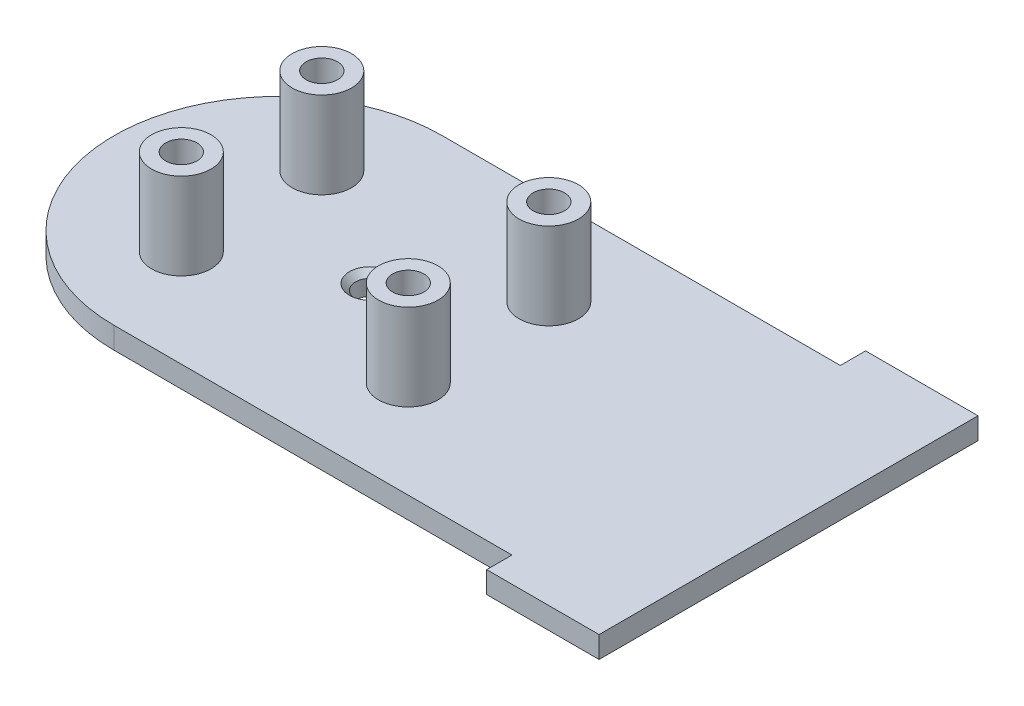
from build123d import *

# Parameters (mm, degrees)
BASE_SHAPE_DEPTH            = 2
SCREW_HOLE_SKETCH_R         = 1.35
SCREW_HOLE_DEPTH            = 51.413108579
PCB_CUTOUT_SKETCH_W         = 9
PCB_CUTOUT_SKETCH_H         = 11
CAMERA_PCB_CUTOUT_DEPTH     = 1.5
CAMERA_RIBBON_ROUTING_DEPTH = 9
SKETCH_1_R                  = 2.75
EXTRUDE_1_DEPTH             = 8
SKETCH_2_R                  = 1.45
CUT_EXTRUDE_1_DEPTH         = 5
MOVE_FACE_1_BY              = 1.5


with BuildPart() as part:
    # Base Shape Sketch → Base Shape (new body)
    with BuildSketch(Plane(origin=(0, 0, 0), x_dir=(1, 0, 0), z_dir=(0, 1, 0))):
        with BuildLine():
            Line((0, 15.19), (38.325, 15.19))
            Line((38.325, 15.19), (38.325, 17.5294293))
            Line((38.325, 17.5294293), (47.225, 17.5294293))
            Line((47.225, 17.5294293), (47.225, -17.5294293))
            Line((47.225, -17.5294293), (36.825, -17.5294293))
            Line((36.825, -17.5294293), (36.825, -15.19))
            Line((36.825, -15.19), (0, -15.19))
            ThreePointArc((0, -15.19), (-15.19, 0), (0, 15.19))
        make_face()
    extrude(amount=BASE_SHAPE_DEPTH)

    # Screw Hole Sketch → Screw Hole (cut, through all)
    with BuildSketch(Plane(origin=(0, 2, 0), x_dir=(1, 0, 0), z_dir=(0, 1, 0))):
        with Locations(Location((8.5, 0, 0), (0, 0, 270))):
            Circle(SCREW_HOLE_SKETCH_R)
    extrude(amount=-SCREW_HOLE_DEPTH, mode=Mode.SUBTRACT)

    # Countersink Sketch → Screw Hole Countersink (revolve, cut)
    with BuildSketch(Plane.XY, mode=Mode.PRIVATE) as screw_hole_countersink_sk:
        Polygon((8.5, 2), (8.5, 0.8), (9.5, 0.8), (9.5, 1.1), (10.4, 2), align=None)
    revolve(screw_hole_countersink_sk.sketch.rotate(Axis((8.5, 2, 0), (0, -1, 0)), 90), axis=Axis((8.5, 2, 0), (0, -1, 0)), mode=Mode.SUBTRACT)

    # PCB Cutout Sketch → Camera PCB Cutout (cut)
    with BuildSketch(Plane.XZ):
        with Locations((0, -1)):
            Rectangle(PCB_CUTOUT_SKETCH_W, PCB_CUTOUT_SKETCH_H)
    extrude(amount=-CAMERA_PCB_CUTOUT_DEPTH, mode=Mode.SUBTRACT)

    # Ribbon Routing Sketch → Camera Ribbon Routing (cut)
    with BuildSketch(Plane.ZY.offset(-4.5)):
        Polygon((-6.5, 1.5), (-12.098076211, 0), (-6.5, 0), align=None)
        Polygon((4.5, 0), (10.09807621, 0), (4.5, 1.5), align=None)
    extrude(amount=CAMERA_RIBBON_ROUTING_DEPTH, mode=Mode.SUBTRACT)

    # Sketch 1 → Extrude 1 (add)
    with BuildSketch(Plane(origin=(0, 2, 0), x_dir=(1, 0, 0), z_dir=(0, 1, 0))):
        with Locations(Location((-2.775, 6.816883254, 0), (0, 0, 270))):
            Circle(SKETCH_1_R)
        with Locations(Location((18.225, 6.816883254, 0), (0, 0, 270))):
            Circle(SKETCH_1_R)
        with Locations(Location((-2.775, -6.183116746, 0), (0, 0, 270))):
            Circle(SKETCH_1_R)
        with Locations(Location((18.225, -6.183116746, 0), (0, 0, 270))):
            Circle(SKETCH_1_R)
    extrude(amount=EXTRUDE_1_DEPTH)

    # Sketch 2 → Cut-Extrude 1 (cut)
    with BuildSketch(Plane(origin=(0, 10, 0), x_dir=(1, 0, 0), z_dir=(0, 1, 0))):
        with Locations(Location((-2.775, 6.816883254, 0), (0, 0, 270))):
            Circle(SKETCH_2_R)
        with Locations(Location((18.225, 6.816883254, 0), (0, 0, 270))):
            Circle(SKETCH_2_R)
        with Locations(Location((-2.775, -6.183116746, 0), (0, 0, 270))):
            Circle(SKETCH_2_R)
        with Locations(Location((18.225, -6.183116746, 0), (0, 0, 270))):
            Circle(SKETCH_2_R)
    extrude(amount=-CUT_EXTRUDE_1_DEPTH, mode=Mode.SUBTRACT)

    # Move Face 1: a face moved outward by 1.5
    extrude(part.faces().sort_by_distance((38.325, 1, -16.35971465))[0], amount=MOVE_FACE_1_BY, dir=(-1, 0, 0))


solid = part.part
